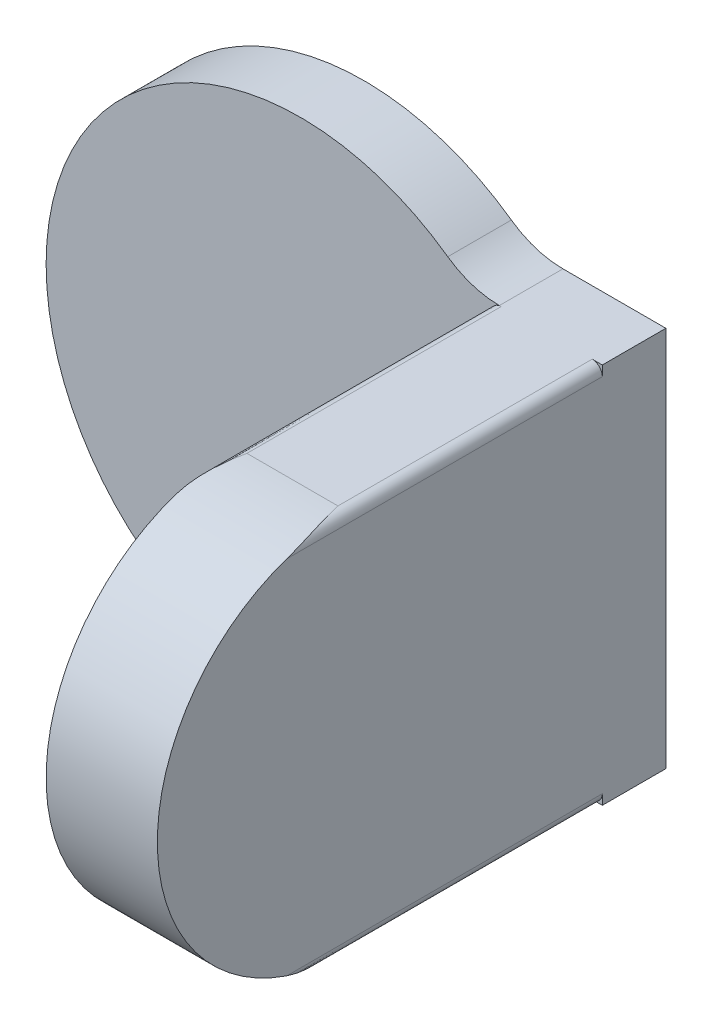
ISO-10303-21;
HEADER;
FILE_DESCRIPTION(('STEP AP214'),'2;1');
FILE_NAME('part.step','',(''),(''),'','','');
FILE_SCHEMA(('AUTOMOTIVE_DESIGN { 1 0 10303 214 1 1 1 1 }'));
ENDSEC;
DATA;
#1=APPLICATION_CONTEXT('core data for automotive mechanical design processes');
#2=APPLICATION_PROTOCOL_DEFINITION('international standard','automotive_design',2000,#1);
#3=PRODUCT_CONTEXT('',#1,'mechanical');
#4=PRODUCT('Part','Part','',(#3));
#5=PRODUCT_RELATED_PRODUCT_CATEGORY('part','',(#4));
#6=PRODUCT_DEFINITION_FORMATION('','',#4);
#7=PRODUCT_DEFINITION_CONTEXT('part definition',#1,'design');
#8=PRODUCT_DEFINITION('design','',#6,#7);
#9=PRODUCT_DEFINITION_SHAPE('','',#8);
#10=(LENGTH_UNIT() NAMED_UNIT(*) SI_UNIT(.MILLI.,.METRE.));
#11=(NAMED_UNIT(*) PLANE_ANGLE_UNIT() SI_UNIT($,.RADIAN.));
#12=(NAMED_UNIT(*) SI_UNIT($,.STERADIAN.) SOLID_ANGLE_UNIT());
#13=UNCERTAINTY_MEASURE_WITH_UNIT(LENGTH_MEASURE(1.E-05),#10,'distance_accuracy_value','');
#14=(GEOMETRIC_REPRESENTATION_CONTEXT(3) GLOBAL_UNCERTAINTY_ASSIGNED_CONTEXT((#13)) GLOBAL_UNIT_ASSIGNED_CONTEXT((#10,
#11,#12)) REPRESENTATION_CONTEXT('',''));
#15=CARTESIAN_POINT('',(0.,0.,0.));
#16=DIRECTION('',(0.,0.,1.));
#17=DIRECTION('',(1.,0.,0.));
#18=AXIS2_PLACEMENT_3D('',#15,#16,#17);
#19=CARTESIAN_POINT('',(30.,0.,50.));
#20=DIRECTION('',(1.,0.,0.));
#21=DIRECTION('',(0.,1.,0.));
#22=AXIS2_PLACEMENT_3D('',#19,#20,#21);
#23=CYLINDRICAL_SURFACE('',#22,30.);
#24=DIRECTION('',(1.,0.,0.));
#25=VECTOR('',#24,1.);
#26=CARTESIAN_POINT('',(30.,-30.,50.));
#27=LINE('',#26,#25);
#28=CARTESIAN_POINT('',(31.59,-30.,50.));
#29=VERTEX_POINT('',#28);
#30=CARTESIAN_POINT('',(45.91,-30.,50.));
#31=VERTEX_POINT('',#30);
#32=EDGE_CURVE('E200',#29,#31,#27,.T.);
#33=ORIENTED_EDGE('',*,*,#32,.T.);
#34=CARTESIAN_POINT('',(47.5,-28.41,59.6370067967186));
#35=CARTESIAN_POINT('',(47.4999913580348,-28.4528668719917,59.5106360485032));
#36=CARTESIAN_POINT('',(47.4982675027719,-28.494885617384,59.3839912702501));
#37=CARTESIAN_POINT('',(47.4917248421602,-28.5772027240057,59.1302392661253));
#38=CARTESIAN_POINT('',(47.486906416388,-28.6175012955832,59.0031320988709));
#39=CARTESIAN_POINT('',(47.4683205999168,-28.735739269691,58.6213820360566));
#40=CARTESIAN_POINT('',(47.4504216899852,-28.8110826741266,58.3661285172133));
#41=CARTESIAN_POINT('',(47.4056882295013,-28.9546638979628,57.8548000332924));
#42=CARTESIAN_POINT('',(47.3788651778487,-29.0229107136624,57.5987265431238));
#43=CARTESIAN_POINT('',(47.3178460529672,-29.1524241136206,57.08563308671));
#44=CARTESIAN_POINT('',(47.2836480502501,-29.2136888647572,56.8286128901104));
#45=CARTESIAN_POINT('',(47.2072406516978,-29.3322213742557,56.3006132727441));
#46=CARTESIAN_POINT('',(47.1647089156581,-29.3891197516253,56.0295979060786));
#47=CARTESIAN_POINT('',(47.0741330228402,-29.4952454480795,55.4869786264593));
#48=CARTESIAN_POINT('',(47.0260883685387,-29.5444720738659,55.2153746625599));
#49=CARTESIAN_POINT('',(46.8752512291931,-29.6807386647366,54.3997399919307));
#50=CARTESIAN_POINT('',(46.7657719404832,-29.7563413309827,53.8549937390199));
#51=CARTESIAN_POINT('',(46.5358413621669,-29.8774145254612,52.7643085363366));
#52=CARTESIAN_POINT('',(46.4153848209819,-29.9228705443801,52.2183691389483));
#53=CARTESIAN_POINT('',(46.1692153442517,-29.9838407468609,51.1261700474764));
#54=CARTESIAN_POINT('',(46.0435044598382,-29.9993665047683,50.5799105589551));
#55=CARTESIAN_POINT('',(45.9151811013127,-29.9999936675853,50.0225052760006));
#56=CARTESIAN_POINT('',(45.9125905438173,-29.9999999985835,50.0112526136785));
#57=CARTESIAN_POINT('',(45.91,-30.,50.));
#58=B_SPLINE_CURVE_WITH_KNOTS('',3,(#34,#35,#36,#37,#38,#39,#40,#41,#42,#43,#44,#45,#46,#47,#48,
#49,#50,#51,#52,#53,#54,#55,#56,#57),.UNSPECIFIED.,.F.,.F.,(4,2,2,2,2,2,2,2,2,2,2,4),(0.,
0.400295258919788,0.800541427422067,1.60045769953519,2.39934723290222,3.1984460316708,
4.03877949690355,4.8791888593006,6.56034026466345,8.24230020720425,9.92360958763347,
9.95825060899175),.UNSPECIFIED.);
#59=CARTESIAN_POINT('',(47.5,-28.41,59.6370067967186));
#60=VERTEX_POINT('',#59);
#61=EDGE_CURVE('E202',#31,#60,#58,.F.);
#62=ORIENTED_EDGE('',*,*,#61,.T.);
#63=CARTESIAN_POINT('',(47.5,0.,50.));
#64=DIRECTION('',(1.,0.,0.));
#65=DIRECTION('',(0.,1.,0.));
#66=AXIS2_PLACEMENT_3D('',#63,#64,#65);
#67=CIRCLE('',#66,30.);
#68=CARTESIAN_POINT('',(47.5,28.41,59.6370067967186));
#69=VERTEX_POINT('',#68);
#70=EDGE_CURVE('E318',#69,#60,#67,.T.);
#71=ORIENTED_EDGE('',*,*,#70,.F.);
#72=CARTESIAN_POINT('',(47.5,28.41,59.6370067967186));
#73=CARTESIAN_POINT('',(47.4999913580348,28.4528668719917,59.5106360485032));
#74=CARTESIAN_POINT('',(47.4982675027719,28.494885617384,59.3839912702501));
#75=CARTESIAN_POINT('',(47.4917248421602,28.5772027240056,59.1302392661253));
#76=CARTESIAN_POINT('',(47.4869064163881,28.6175012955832,59.0031320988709));
#77=CARTESIAN_POINT('',(47.4683205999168,28.735739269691,58.6213820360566));
#78=CARTESIAN_POINT('',(47.4504216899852,28.8110826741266,58.3661285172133));
#79=CARTESIAN_POINT('',(47.4056882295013,28.9546638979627,57.8548000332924));
#80=CARTESIAN_POINT('',(47.3788651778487,29.0229107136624,57.5987265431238));
#81=CARTESIAN_POINT('',(47.3178460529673,29.1524241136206,57.08563308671));
#82=CARTESIAN_POINT('',(47.2836480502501,29.2136888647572,56.8286128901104));
#83=CARTESIAN_POINT('',(47.2072406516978,29.3322213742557,56.3006132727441));
#84=CARTESIAN_POINT('',(47.1647089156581,29.3891197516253,56.0295979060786));
#85=CARTESIAN_POINT('',(47.0741330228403,29.4952454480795,55.4869786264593));
#86=CARTESIAN_POINT('',(47.0260883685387,29.5444720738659,55.2153746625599));
#87=CARTESIAN_POINT('',(46.8752512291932,29.6807386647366,54.3997399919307));
#88=CARTESIAN_POINT('',(46.7657719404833,29.7563413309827,53.8549937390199));
#89=CARTESIAN_POINT('',(46.5358413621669,29.8774145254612,52.7643085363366));
#90=CARTESIAN_POINT('',(46.415384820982,29.9228705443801,52.2183691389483));
#91=CARTESIAN_POINT('',(46.1692153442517,29.9838407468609,51.1261700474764));
#92=CARTESIAN_POINT('',(46.0435044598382,29.9993665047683,50.5799105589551));
#93=CARTESIAN_POINT('',(45.9151811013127,29.9999936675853,50.0225052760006));
#94=CARTESIAN_POINT('',(45.9125905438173,29.9999999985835,50.0112526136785));
#95=CARTESIAN_POINT('',(45.91,30.,50.));
#96=B_SPLINE_CURVE_WITH_KNOTS('',3,(#72,#73,#74,#75,#76,#77,#78,#79,#80,#81,#82,#83,#84,#85,#86,
#87,#88,#89,#90,#91,#92,#93,#94,#95),.UNSPECIFIED.,.F.,.F.,(4,2,2,2,2,2,2,2,2,2,2,4),(0.,
0.400295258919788,0.800541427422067,1.60045769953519,2.39934723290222,3.1984460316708,
4.03877949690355,4.8791888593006,6.56034026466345,8.24230020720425,9.92360958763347,
9.95825060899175),.UNSPECIFIED.);
#97=CARTESIAN_POINT('',(45.91,30.,50.));
#98=VERTEX_POINT('',#97);
#99=EDGE_CURVE('E156',#69,#98,#96,.T.);
#100=ORIENTED_EDGE('',*,*,#99,.T.);
#101=DIRECTION('',(1.,0.,0.));
#102=VECTOR('',#101,1.);
#103=CARTESIAN_POINT('',(30.,30.,50.));
#104=LINE('',#103,#102);
#105=CARTESIAN_POINT('',(31.59,30.,50.));
#106=VERTEX_POINT('',#105);
#107=EDGE_CURVE('E207',#106,#98,#104,.T.);
#108=ORIENTED_EDGE('',*,*,#107,.F.);
#109=CARTESIAN_POINT('',(30.,28.41,59.6370067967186));
#110=CARTESIAN_POINT('',(30.0000086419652,28.4528668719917,59.5106360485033));
#111=CARTESIAN_POINT('',(30.0017324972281,28.494885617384,59.3839912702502));
#112=CARTESIAN_POINT('',(30.0082751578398,28.5772027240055,59.1302392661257));
#113=CARTESIAN_POINT('',(30.0130935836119,28.6175012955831,59.0031320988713));
#114=CARTESIAN_POINT('',(30.0316794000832,28.7357392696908,58.6213820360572));
#115=CARTESIAN_POINT('',(30.0495783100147,28.8110826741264,58.3661285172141));
#116=CARTESIAN_POINT('',(30.0943117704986,28.9546638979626,57.8548000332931));
#117=CARTESIAN_POINT('',(30.1211348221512,29.0229107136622,57.5987265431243));
#118=CARTESIAN_POINT('',(30.1821539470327,29.1524241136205,57.0856330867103));
#119=CARTESIAN_POINT('',(30.2163519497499,29.2136888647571,56.8286128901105));
#120=CARTESIAN_POINT('',(30.2927593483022,29.3322213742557,56.3006132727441));
#121=CARTESIAN_POINT('',(30.3352910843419,29.3891197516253,56.0295979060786));
#122=CARTESIAN_POINT('',(30.4258669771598,29.4952454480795,55.4869786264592));
#123=CARTESIAN_POINT('',(30.4739116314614,29.5444720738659,55.2153746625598));
#124=CARTESIAN_POINT('',(30.6247487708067,29.6807386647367,54.3997399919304));
#125=CARTESIAN_POINT('',(30.734228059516,29.7563413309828,53.8549937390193));
#126=CARTESIAN_POINT('',(30.964158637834,29.8774145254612,52.7643085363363));
#127=CARTESIAN_POINT('',(31.0846151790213,29.9228705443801,52.2183691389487));
#128=CARTESIAN_POINT('',(31.3307846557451,29.9838407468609,51.1261700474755));
#129=CARTESIAN_POINT('',(31.4564955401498,29.9993665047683,50.5799105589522));
#130=CARTESIAN_POINT('',(31.5848188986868,29.9999936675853,50.0225052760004));
#131=CARTESIAN_POINT('',(31.5874094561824,29.9999999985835,50.0112526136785));
#132=CARTESIAN_POINT('',(31.59,30.,50.));
#133=B_SPLINE_CURVE_WITH_KNOTS('',3,(#109,#110,#111,#112,#113,#114,#115,#116,#117,#118,#119,
#120,#121,#122,#123,#124,#125,#126,#127,#128,#129,#130,#131,#132),.UNSPECIFIED.,.F.,.F.,(4,2,2,
2,2,2,2,2,2,2,2,4),(0.,0.400295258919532,0.800541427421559,1.60045769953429,2.3993472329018,
3.1984460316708,4.03877949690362,4.87918885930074,6.56034026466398,8.24230020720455,
9.92360958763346,9.95825060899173),.UNSPECIFIED.);
#134=CARTESIAN_POINT('',(30.,28.41,59.6370067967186));
#135=VERTEX_POINT('',#134);
#136=EDGE_CURVE('E267',#106,#135,#133,.F.);
#137=ORIENTED_EDGE('',*,*,#136,.T.);
#138=CARTESIAN_POINT('',(30.,0.,50.));
#139=DIRECTION('',(1.,0.,0.));
#140=DIRECTION('',(0.,1.,0.));
#141=AXIS2_PLACEMENT_3D('',#138,#139,#140);
#142=CIRCLE('',#141,30.);
#143=CARTESIAN_POINT('',(30.,-28.41,59.6370067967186));
#144=VERTEX_POINT('',#143);
#145=EDGE_CURVE('E212',#135,#144,#142,.T.);
#146=ORIENTED_EDGE('',*,*,#145,.T.);
#147=CARTESIAN_POINT('',(30.,-28.41,59.6370067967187));
#148=CARTESIAN_POINT('',(30.0000086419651,-28.4528668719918,59.510636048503));
#149=CARTESIAN_POINT('',(30.001732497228,-28.4948856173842,59.3839912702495));
#150=CARTESIAN_POINT('',(30.0082751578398,-28.577202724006,59.1302392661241));
#151=CARTESIAN_POINT('',(30.013093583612,-28.6175012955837,59.0031320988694));
#152=CARTESIAN_POINT('',(30.0316794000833,-28.7357392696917,58.6213820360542));
#153=CARTESIAN_POINT('',(30.049578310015,-28.8110826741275,58.3661285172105));
#154=CARTESIAN_POINT('',(30.094311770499,-28.9546638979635,57.8548000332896));
#155=CARTESIAN_POINT('',(30.1211348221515,-29.0229107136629,57.5987265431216));
#156=CARTESIAN_POINT('',(30.1821539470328,-29.1524241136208,57.085633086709));
#157=CARTESIAN_POINT('',(30.2163519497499,-29.2136888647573,56.8286128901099));
#158=CARTESIAN_POINT('',(30.2927593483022,-29.3322213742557,56.3006132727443));
#159=CARTESIAN_POINT('',(30.3352910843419,-29.3891197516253,56.0295979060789));
#160=CARTESIAN_POINT('',(30.4258669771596,-29.4952454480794,55.4869786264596));
#161=CARTESIAN_POINT('',(30.4739116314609,-29.5444720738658,55.2153746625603));
#162=CARTESIAN_POINT('',(30.6247487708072,-29.6807386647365,54.3997399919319));
#163=CARTESIAN_POINT('',(30.7342280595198,-29.7563413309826,53.8549937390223));
#164=CARTESIAN_POINT('',(30.9641586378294,-29.877414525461,52.7643085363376));
#165=CARTESIAN_POINT('',(31.0846151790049,-29.9228705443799,52.2183691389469));
#166=CARTESIAN_POINT('',(31.3307846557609,-29.9838407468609,51.1261700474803));
#167=CARTESIAN_POINT('',(31.4564955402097,-29.9993665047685,50.5799105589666));
#168=CARTESIAN_POINT('',(31.5848188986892,-29.9999936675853,50.0225052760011));
#169=CARTESIAN_POINT('',(31.5874094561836,-29.9999999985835,50.0112526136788));
#170=CARTESIAN_POINT('',(31.59,-30.,50.));
#171=B_SPLINE_CURVE_WITH_KNOTS('',3,(#147,#148,#149,#150,#151,#152,#153,#154,#155,#156,#157,
#158,#159,#160,#161,#162,#163,#164,#165,#166,#167,#168,#169,#170),.UNSPECIFIED.,.F.,.F.,(4,2,2,
2,2,2,2,2,2,2,2,4),(0.,0.400295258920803,0.800541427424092,1.60045769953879,2.39934723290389,
3.1984460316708,4.0387794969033,4.87918885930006,6.56034026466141,8.24230020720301,
9.92360958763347,9.95825060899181),.UNSPECIFIED.);
#172=EDGE_CURVE('E204',#144,#29,#171,.T.);
#173=ORIENTED_EDGE('',*,*,#172,.T.);
#174=EDGE_LOOP('',(#33,#62,#71,#100,#108,#137,#146,#173));
#175=FACE_BOUND('',#174,.T.);
#176=ADVANCED_FACE('F33',(#175),#23,.T.);
#177=CARTESIAN_POINT('',(31.3049516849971,-30.,10.));
#178=DIRECTION('',(0.,1.,0.));
#179=DIRECTION('',(0.,0.,1.));
#180=AXIS2_PLACEMENT_3D('',#177,#178,#179);
#181=PLANE('',#180);
#182=DIRECTION('',(0.,0.,-1.));
#183=VECTOR('',#182,1.);
#184=CARTESIAN_POINT('',(45.91,-30.,80.));
#185=LINE('',#184,#183);
#186=CARTESIAN_POINT('',(45.91,-30.,10.));
#187=VERTEX_POINT('',#186);
#188=EDGE_CURVE('E11',#31,#187,#185,.T.);
#189=ORIENTED_EDGE('',*,*,#188,.F.);
#190=ORIENTED_EDGE('',*,*,#32,.F.);
#191=DIRECTION('',(0.,0.,-1.));
#192=VECTOR('',#191,1.);
#193=CARTESIAN_POINT('',(31.59,-30.,80.));
#194=LINE('',#193,#192);
#195=CARTESIAN_POINT('',(31.59,-30.,10.));
#196=VERTEX_POINT('',#195);
#197=EDGE_CURVE('E296',#29,#196,#194,.T.);
#198=ORIENTED_EDGE('',*,*,#197,.T.);
#199=DIRECTION('',(1.,0.,0.));
#200=VECTOR('',#199,1.);
#201=CARTESIAN_POINT('',(31.59,-30.,10.));
#202=LINE('',#201,#200);
#203=CARTESIAN_POINT('',(31.3049516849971,-30.,10.));
#204=VERTEX_POINT('',#203);
#205=EDGE_CURVE('E260',#204,#196,#202,.T.);
#206=ORIENTED_EDGE('',*,*,#205,.F.);
#207=DIRECTION('',(0.,0.,-1.));
#208=VECTOR('',#207,1.);
#209=CARTESIAN_POINT('',(31.3049516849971,-30.,10.));
#210=LINE('',#209,#208);
#211=CARTESIAN_POINT('',(31.3049516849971,-30.,0.));
#212=VERTEX_POINT('',#211);
#213=EDGE_CURVE('E153',#204,#212,#210,.T.);
#214=ORIENTED_EDGE('',*,*,#213,.T.);
#215=DIRECTION('',(1.,0.,0.));
#216=VECTOR('',#215,1.);
#217=CARTESIAN_POINT('',(31.3049516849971,-30.,0.));
#218=LINE('',#217,#216);
#219=CARTESIAN_POINT('',(47.5,-30.,0.));
#220=VERTEX_POINT('',#219);
#221=EDGE_CURVE('E151',#212,#220,#218,.T.);
#222=ORIENTED_EDGE('',*,*,#221,.T.);
#223=DIRECTION('',(0.,0.,-1.));
#224=VECTOR('',#223,1.);
#225=CARTESIAN_POINT('',(47.5,-30.,10.));
#226=LINE('',#225,#224);
#227=CARTESIAN_POINT('',(47.5,-30.,10.));
#228=VERTEX_POINT('',#227);
#229=EDGE_CURVE('E145',#228,#220,#226,.T.);
#230=ORIENTED_EDGE('',*,*,#229,.F.);
#231=DIRECTION('',(1.,0.,0.));
#232=VECTOR('',#231,1.);
#233=CARTESIAN_POINT('',(45.91,-30.,10.));
#234=LINE('',#233,#232);
#235=EDGE_CURVE('E132',#187,#228,#234,.T.);
#236=ORIENTED_EDGE('',*,*,#235,.F.);
#237=EDGE_LOOP('',(#189,#190,#198,#206,#214,#222,#230,#236));
#238=FACE_BOUND('',#237,.T.);
#239=ADVANCED_FACE('F149',(#238),#181,.F.);
#240=CARTESIAN_POINT('',(30.,0.,50.));
#241=DIRECTION('',(1.,0.,0.));
#242=DIRECTION('',(0.,1.,0.));
#243=AXIS2_PLACEMENT_3D('',#240,#241,#242);
#244=PLANE('',#243);
#245=DIRECTION('',(0.,0.,-1.));
#246=VECTOR('',#245,1.);
#247=CARTESIAN_POINT('',(30.,-28.41,80.));
#248=LINE('',#247,#246);
#249=CARTESIAN_POINT('',(30.,-28.41,10.));
#250=VERTEX_POINT('',#249);
#251=EDGE_CURVE('E41',#144,#250,#248,.T.);
#252=ORIENTED_EDGE('',*,*,#251,.F.);
#253=ORIENTED_EDGE('',*,*,#145,.F.);
#254=DIRECTION('',(0.,0.,-1.));
#255=VECTOR('',#254,1.);
#256=CARTESIAN_POINT('',(30.,28.41,80.));
#257=LINE('',#256,#255);
#258=CARTESIAN_POINT('',(30.,28.41,10.));
#259=VERTEX_POINT('',#258);
#260=EDGE_CURVE('E169',#135,#259,#257,.T.);
#261=ORIENTED_EDGE('',*,*,#260,.T.);
#262=DIRECTION('',(0.,-1.,0.));
#263=VECTOR('',#262,1.);
#264=CARTESIAN_POINT('',(30.,-44.,10.));
#265=LINE('',#264,#263);
#266=EDGE_CURVE('E206',#259,#250,#265,.T.);
#267=ORIENTED_EDGE('',*,*,#266,.T.);
#268=EDGE_LOOP('',(#252,#253,#261,#267));
#269=FACE_BOUND('',#268,.T.);
#270=ADVANCED_FACE('F181',(#269),#244,.F.);
#271=CARTESIAN_POINT('',(31.3049516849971,30.,10.));
#272=DIRECTION('',(0.,-1.,0.));
#273=DIRECTION('',(1.,0.,0.));
#274=AXIS2_PLACEMENT_3D('',#271,#272,#273);
#275=PLANE('',#274);
#276=DIRECTION('',(0.,0.,-1.));
#277=VECTOR('',#276,1.);
#278=CARTESIAN_POINT('',(31.59,30.,80.));
#279=LINE('',#278,#277);
#280=CARTESIAN_POINT('',(31.59,30.,10.));
#281=VERTEX_POINT('',#280);
#282=EDGE_CURVE('E265',#106,#281,#279,.T.);
#283=ORIENTED_EDGE('',*,*,#282,.F.);
#284=ORIENTED_EDGE('',*,*,#107,.T.);
#285=DIRECTION('',(0.,0.,-1.));
#286=VECTOR('',#285,1.);
#287=CARTESIAN_POINT('',(45.91,30.,80.));
#288=LINE('',#287,#286);
#289=CARTESIAN_POINT('',(45.91,30.,10.));
#290=VERTEX_POINT('',#289);
#291=EDGE_CURVE('E311',#98,#290,#288,.T.);
#292=ORIENTED_EDGE('',*,*,#291,.T.);
#293=DIRECTION('',(-1.,0.,0.));
#294=VECTOR('',#293,1.);
#295=CARTESIAN_POINT('',(45.91,30.,10.));
#296=LINE('',#295,#294);
#297=CARTESIAN_POINT('',(47.5,30.,10.));
#298=VERTEX_POINT('',#297);
#299=EDGE_CURVE('E316',#298,#290,#296,.T.);
#300=ORIENTED_EDGE('',*,*,#299,.F.);
#301=DIRECTION('',(0.,0.,-1.));
#302=VECTOR('',#301,1.);
#303=CARTESIAN_POINT('',(47.5,30.,10.));
#304=LINE('',#303,#302);
#305=CARTESIAN_POINT('',(47.5,30.,0.));
#306=VERTEX_POINT('',#305);
#307=EDGE_CURVE('E154',#298,#306,#304,.T.);
#308=ORIENTED_EDGE('',*,*,#307,.T.);
#309=DIRECTION('',(-1.,0.,0.));
#310=VECTOR('',#309,1.);
#311=CARTESIAN_POINT('',(31.3049516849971,30.,0.));
#312=LINE('',#311,#310);
#313=CARTESIAN_POINT('',(31.3049516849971,30.,0.));
#314=VERTEX_POINT('',#313);
#315=EDGE_CURVE('E222',#306,#314,#312,.T.);
#316=ORIENTED_EDGE('',*,*,#315,.T.);
#317=DIRECTION('',(0.,0.,-1.));
#318=VECTOR('',#317,1.);
#319=CARTESIAN_POINT('',(31.3049516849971,30.,10.));
#320=LINE('',#319,#318);
#321=CARTESIAN_POINT('',(31.3049516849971,30.,10.));
#322=VERTEX_POINT('',#321);
#323=EDGE_CURVE('E158',#322,#314,#320,.T.);
#324=ORIENTED_EDGE('',*,*,#323,.F.);
#325=DIRECTION('',(-1.,0.,0.));
#326=VECTOR('',#325,1.);
#327=CARTESIAN_POINT('',(31.59,30.,10.));
#328=LINE('',#327,#326);
#329=EDGE_CURVE('E262',#281,#322,#328,.T.);
#330=ORIENTED_EDGE('',*,*,#329,.F.);
#331=EDGE_LOOP('',(#283,#284,#292,#300,#308,#316,#324,#330));
#332=FACE_BOUND('',#331,.T.);
#333=ADVANCED_FACE('F183',(#332),#275,.F.);
#334=CARTESIAN_POINT('',(47.5,30.,10.));
#335=DIRECTION('',(-1.,0.,0.));
#336=DIRECTION('',(0.,-1.,0.));
#337=AXIS2_PLACEMENT_3D('',#334,#335,#336);
#338=PLANE('',#337);
#339=ORIENTED_EDGE('',*,*,#70,.T.);
#340=DIRECTION('',(0.,0.,-1.));
#341=VECTOR('',#340,1.);
#342=CARTESIAN_POINT('',(47.5,-28.41,80.));
#343=LINE('',#342,#341);
#344=CARTESIAN_POINT('',(47.5,-28.41,10.));
#345=VERTEX_POINT('',#344);
#346=EDGE_CURVE('E147',#60,#345,#343,.T.);
#347=ORIENTED_EDGE('',*,*,#346,.T.);
#348=DIRECTION('',(0.,1.,0.));
#349=VECTOR('',#348,1.);
#350=CARTESIAN_POINT('',(47.5,-30.,10.));
#351=LINE('',#350,#349);
#352=EDGE_CURVE('E135',#228,#345,#351,.T.);
#353=ORIENTED_EDGE('',*,*,#352,.F.);
#354=ORIENTED_EDGE('',*,*,#229,.T.);
#355=DIRECTION('',(0.,1.,0.));
#356=VECTOR('',#355,1.);
#357=CARTESIAN_POINT('',(47.5,30.,0.));
#358=LINE('',#357,#356);
#359=EDGE_CURVE('E220',#220,#306,#358,.T.);
#360=ORIENTED_EDGE('',*,*,#359,.T.);
#361=ORIENTED_EDGE('',*,*,#307,.F.);
#362=DIRECTION('',(0.,1.,0.));
#363=VECTOR('',#362,1.);
#364=CARTESIAN_POINT('',(47.5,30.,10.));
#365=LINE('',#364,#363);
#366=CARTESIAN_POINT('',(47.5,28.41,10.));
#367=VERTEX_POINT('',#366);
#368=EDGE_CURVE('E320',#367,#298,#365,.T.);
#369=ORIENTED_EDGE('',*,*,#368,.F.);
#370=DIRECTION('',(0.,0.,-1.));
#371=VECTOR('',#370,1.);
#372=CARTESIAN_POINT('',(47.5,28.41,80.));
#373=LINE('',#372,#371);
#374=EDGE_CURVE('E315',#69,#367,#373,.T.);
#375=ORIENTED_EDGE('',*,*,#374,.F.);
#376=EDGE_LOOP('',(#339,#347,#353,#354,#360,#361,#369,#375));
#377=FACE_BOUND('',#376,.T.);
#378=ADVANCED_FACE('F143',(#377),#338,.F.);
#379=CARTESIAN_POINT('',(31.3049516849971,-44.,10.));
#380=DIRECTION('',(0.,0.,-1.));
#381=DIRECTION('',(-1.,0.,0.));
#382=AXIS2_PLACEMENT_3D('',#379,#380,#381);
#383=CYLINDRICAL_SURFACE('',#382,14.);
#384=CARTESIAN_POINT('',(31.3049516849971,-44.,0.));
#385=DIRECTION('',(0.,0.,-1.));
#386=DIRECTION('',(-1.,0.,0.));
#387=AXIS2_PLACEMENT_3D('',#384,#385,#386);
#388=CIRCLE('',#387,14.);
#389=CARTESIAN_POINT('',(23.1888530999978,-32.5925925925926,0.));
#390=VERTEX_POINT('',#389);
#391=EDGE_CURVE('E210',#390,#212,#388,.T.);
#392=ORIENTED_EDGE('',*,*,#391,.T.);
#393=ORIENTED_EDGE('',*,*,#213,.F.);
#394=CARTESIAN_POINT('',(31.3049516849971,-44.,10.));
#395=DIRECTION('',(0.,0.,-1.));
#396=DIRECTION('',(-1.,0.,0.));
#397=AXIS2_PLACEMENT_3D('',#394,#395,#396);
#398=CIRCLE('',#397,14.);
#399=CARTESIAN_POINT('',(23.1888530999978,-32.5925925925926,10.));
#400=VERTEX_POINT('',#399);
#401=EDGE_CURVE('E228',#400,#204,#398,.T.);
#402=ORIENTED_EDGE('',*,*,#401,.F.);
#403=DIRECTION('',(0.,0.,-1.));
#404=VECTOR('',#403,1.);
#405=CARTESIAN_POINT('',(23.1888530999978,-32.5925925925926,10.));
#406=LINE('',#405,#404);
#407=EDGE_CURVE('E235',#400,#390,#406,.T.);
#408=ORIENTED_EDGE('',*,*,#407,.T.);
#409=EDGE_LOOP('',(#392,#393,#402,#408));
#410=FACE_BOUND('',#409,.T.);
#411=ADVANCED_FACE('F35',(#410),#383,.F.);
#412=CARTESIAN_POINT('',(31.304951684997,44.,10.));
#413=DIRECTION('',(0.,0.,-1.));
#414=DIRECTION('',(-1.,0.,0.));
#415=AXIS2_PLACEMENT_3D('',#412,#413,#414);
#416=CYLINDRICAL_SURFACE('',#415,14.);
#417=CARTESIAN_POINT('',(31.304951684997,44.,0.));
#418=DIRECTION('',(0.,0.,-1.));
#419=DIRECTION('',(-1.,0.,0.));
#420=AXIS2_PLACEMENT_3D('',#417,#418,#419);
#421=CIRCLE('',#420,14.);
#422=CARTESIAN_POINT('',(23.1888530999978,32.5925925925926,0.));
#423=VERTEX_POINT('',#422);
#424=EDGE_CURVE('E224',#314,#423,#421,.T.);
#425=ORIENTED_EDGE('',*,*,#424,.T.);
#426=DIRECTION('',(0.,0.,-1.));
#427=VECTOR('',#426,1.);
#428=CARTESIAN_POINT('',(23.1888530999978,32.5925925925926,10.));
#429=LINE('',#428,#427);
#430=CARTESIAN_POINT('',(23.1888530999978,32.5925925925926,10.));
#431=VERTEX_POINT('',#430);
#432=EDGE_CURVE('E238',#431,#423,#429,.T.);
#433=ORIENTED_EDGE('',*,*,#432,.F.);
#434=CARTESIAN_POINT('',(31.304951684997,44.,10.));
#435=DIRECTION('',(0.,0.,-1.));
#436=DIRECTION('',(-1.,0.,0.));
#437=AXIS2_PLACEMENT_3D('',#434,#435,#436);
#438=CIRCLE('',#437,14.);
#439=EDGE_CURVE('E231',#322,#431,#438,.T.);
#440=ORIENTED_EDGE('',*,*,#439,.F.);
#441=ORIENTED_EDGE('',*,*,#323,.T.);
#442=EDGE_LOOP('',(#425,#433,#440,#441));
#443=FACE_BOUND('',#442,.T.);
#444=ADVANCED_FACE('F245',(#443),#416,.F.);
#445=CARTESIAN_POINT('',(0.,0.,10.));
#446=DIRECTION('',(0.,0.,-1.));
#447=DIRECTION('',(-1.,0.,0.));
#448=AXIS2_PLACEMENT_3D('',#445,#446,#447);
#449=CYLINDRICAL_SURFACE('',#448,40.);
#450=CARTESIAN_POINT('',(0.,0.,0.));
#451=DIRECTION('',(0.,0.,1.));
#452=DIRECTION('',(1.,0.,0.));
#453=AXIS2_PLACEMENT_3D('',#450,#451,#452);
#454=CIRCLE('',#453,40.);
#455=EDGE_CURVE('E226',#423,#390,#454,.T.);
#456=ORIENTED_EDGE('',*,*,#455,.T.);
#457=ORIENTED_EDGE('',*,*,#407,.F.);
#458=CARTESIAN_POINT('',(0.,0.,10.));
#459=DIRECTION('',(0.,0.,1.));
#460=DIRECTION('',(1.,0.,0.));
#461=AXIS2_PLACEMENT_3D('',#458,#459,#460);
#462=CIRCLE('',#461,40.);
#463=EDGE_CURVE('E233',#431,#400,#462,.T.);
#464=ORIENTED_EDGE('',*,*,#463,.F.);
#465=ORIENTED_EDGE('',*,*,#432,.T.);
#466=EDGE_LOOP('',(#456,#457,#464,#465));
#467=FACE_BOUND('',#466,.T.);
#468=ADVANCED_FACE('F254',(#467),#449,.T.);
#469=CARTESIAN_POINT('',(31.3049516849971,-44.,10.));
#470=DIRECTION('',(0.,0.,-1.));
#471=DIRECTION('',(-1.,0.,0.));
#472=AXIS2_PLACEMENT_3D('',#469,#470,#471);
#473=PLANE('',#472);
#474=ORIENTED_EDGE('',*,*,#329,.T.);
#475=ORIENTED_EDGE('',*,*,#439,.T.);
#476=ORIENTED_EDGE('',*,*,#463,.T.);
#477=ORIENTED_EDGE('',*,*,#401,.T.);
#478=ORIENTED_EDGE('',*,*,#205,.T.);
#479=CARTESIAN_POINT('',(31.59,-28.41,10.));
#480=DIRECTION('',(0.,0.,-1.));
#481=DIRECTION('',(1.,0.,0.));
#482=AXIS2_PLACEMENT_3D('',#479,#480,#481);
#483=CIRCLE('',#482,1.59);
#484=EDGE_CURVE('E55',#196,#250,#483,.T.);
#485=ORIENTED_EDGE('',*,*,#484,.T.);
#486=ORIENTED_EDGE('',*,*,#266,.F.);
#487=CARTESIAN_POINT('',(31.59,28.41,10.));
#488=DIRECTION('',(0.,0.,-1.));
#489=DIRECTION('',(-1.,0.,0.));
#490=AXIS2_PLACEMENT_3D('',#487,#488,#489);
#491=CIRCLE('',#490,1.59);
#492=EDGE_CURVE('E263',#259,#281,#491,.T.);
#493=ORIENTED_EDGE('',*,*,#492,.T.);
#494=EDGE_LOOP('',(#474,#475,#476,#477,#478,#485,#486,#493));
#495=FACE_BOUND('',#494,.T.);
#496=ADVANCED_FACE('F259',(#495),#473,.F.);
#497=CARTESIAN_POINT('',(31.3049516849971,-44.,0.));
#498=DIRECTION('',(0.,0.,-1.));
#499=DIRECTION('',(-1.,0.,0.));
#500=AXIS2_PLACEMENT_3D('',#497,#498,#499);
#501=PLANE('',#500);
#502=ORIENTED_EDGE('',*,*,#424,.F.);
#503=ORIENTED_EDGE('',*,*,#315,.F.);
#504=ORIENTED_EDGE('',*,*,#359,.F.);
#505=ORIENTED_EDGE('',*,*,#221,.F.);
#506=ORIENTED_EDGE('',*,*,#391,.F.);
#507=ORIENTED_EDGE('',*,*,#455,.F.);
#508=EDGE_LOOP('',(#502,#503,#504,#505,#506,#507));
#509=FACE_BOUND('',#508,.T.);
#510=ADVANCED_FACE('F178',(#509),#501,.T.);
#511=CARTESIAN_POINT('',(45.91,28.41,80.));
#512=DIRECTION('',(0.,0.,-1.));
#513=DIRECTION('',(-1.,0.,0.));
#514=AXIS2_PLACEMENT_3D('',#511,#512,#513);
#515=CYLINDRICAL_SURFACE('',#514,1.59);
#516=ORIENTED_EDGE('',*,*,#374,.T.);
#517=CARTESIAN_POINT('',(45.91,28.41,10.));
#518=DIRECTION('',(0.,0.,-1.));
#519=DIRECTION('',(1.,0.,0.));
#520=AXIS2_PLACEMENT_3D('',#517,#518,#519);
#521=CIRCLE('',#520,1.59);
#522=EDGE_CURVE('E277',#290,#367,#521,.T.);
#523=ORIENTED_EDGE('',*,*,#522,.F.);
#524=ORIENTED_EDGE('',*,*,#291,.F.);
#525=ORIENTED_EDGE('',*,*,#99,.F.);
#526=EDGE_LOOP('',(#516,#523,#524,#525));
#527=FACE_BOUND('',#526,.T.);
#528=ADVANCED_FACE('F173',(#527),#515,.T.);
#529=CARTESIAN_POINT('',(45.91,28.41,10.));
#530=DIRECTION('',(0.,0.,1.));
#531=DIRECTION('',(1.,0.,0.));
#532=AXIS2_PLACEMENT_3D('',#529,#530,#531);
#533=PLANE('',#532);
#534=ORIENTED_EDGE('',*,*,#522,.T.);
#535=ORIENTED_EDGE('',*,*,#368,.T.);
#536=ORIENTED_EDGE('',*,*,#299,.T.);
#537=EDGE_LOOP('',(#534,#535,#536));
#538=FACE_BOUND('',#537,.T.);
#539=ADVANCED_FACE('F177',(#538),#533,.T.);
#540=CARTESIAN_POINT('',(31.59,28.41,80.));
#541=DIRECTION('',(0.,0.,-1.));
#542=DIRECTION('',(-1.,0.,0.));
#543=AXIS2_PLACEMENT_3D('',#540,#541,#542);
#544=CYLINDRICAL_SURFACE('',#543,1.59);
#545=ORIENTED_EDGE('',*,*,#282,.T.);
#546=ORIENTED_EDGE('',*,*,#492,.F.);
#547=ORIENTED_EDGE('',*,*,#260,.F.);
#548=ORIENTED_EDGE('',*,*,#136,.F.);
#549=EDGE_LOOP('',(#545,#546,#547,#548));
#550=FACE_BOUND('',#549,.T.);
#551=ADVANCED_FACE('F279',(#550),#544,.T.);
#552=CARTESIAN_POINT('',(31.59,-28.41,80.));
#553=DIRECTION('',(0.,0.,-1.));
#554=DIRECTION('',(-1.,0.,0.));
#555=AXIS2_PLACEMENT_3D('',#552,#553,#554);
#556=CYLINDRICAL_SURFACE('',#555,1.59);
#557=ORIENTED_EDGE('',*,*,#251,.T.);
#558=ORIENTED_EDGE('',*,*,#484,.F.);
#559=ORIENTED_EDGE('',*,*,#197,.F.);
#560=ORIENTED_EDGE('',*,*,#172,.F.);
#561=EDGE_LOOP('',(#557,#558,#559,#560));
#562=FACE_BOUND('',#561,.T.);
#563=ADVANCED_FACE('F283',(#562),#556,.T.);
#564=CARTESIAN_POINT('',(45.91,-28.41,80.));
#565=DIRECTION('',(0.,0.,-1.));
#566=DIRECTION('',(-1.,0.,0.));
#567=AXIS2_PLACEMENT_3D('',#564,#565,#566);
#568=CYLINDRICAL_SURFACE('',#567,1.59);
#569=ORIENTED_EDGE('',*,*,#188,.T.);
#570=CARTESIAN_POINT('',(45.91,-28.41,10.));
#571=DIRECTION('',(0.,0.,-1.));
#572=DIRECTION('',(-1.,0.,0.));
#573=AXIS2_PLACEMENT_3D('',#570,#571,#572);
#574=CIRCLE('',#573,1.59);
#575=EDGE_CURVE('E48',#345,#187,#574,.T.);
#576=ORIENTED_EDGE('',*,*,#575,.F.);
#577=ORIENTED_EDGE('',*,*,#346,.F.);
#578=ORIENTED_EDGE('',*,*,#61,.F.);
#579=EDGE_LOOP('',(#569,#576,#577,#578));
#580=FACE_BOUND('',#579,.T.);
#581=ADVANCED_FACE('F288',(#580),#568,.T.);
#582=CARTESIAN_POINT('',(45.91,-28.41,10.));
#583=DIRECTION('',(0.,0.,-1.));
#584=DIRECTION('',(-1.,0.,0.));
#585=AXIS2_PLACEMENT_3D('',#582,#583,#584);
#586=PLANE('',#585);
#587=ORIENTED_EDGE('',*,*,#575,.T.);
#588=ORIENTED_EDGE('',*,*,#235,.T.);
#589=ORIENTED_EDGE('',*,*,#352,.T.);
#590=EDGE_LOOP('',(#587,#588,#589));
#591=FACE_BOUND('',#590,.T.);
#592=ADVANCED_FACE('F134',(#591),#586,.F.);
#593=CLOSED_SHELL('',(#176,#239,#270,#333,#378,#411,#444,#468,#496,#510,#528,#539,#551,#563,
#581,#592));
#594=MANIFOLD_SOLID_BREP('B2',#593);
#595=ADVANCED_BREP_SHAPE_REPRESENTATION('',(#18,#594),#14);
#596=SHAPE_DEFINITION_REPRESENTATION(#9,#595);
ENDSEC;
END-ISO-10303-21;
